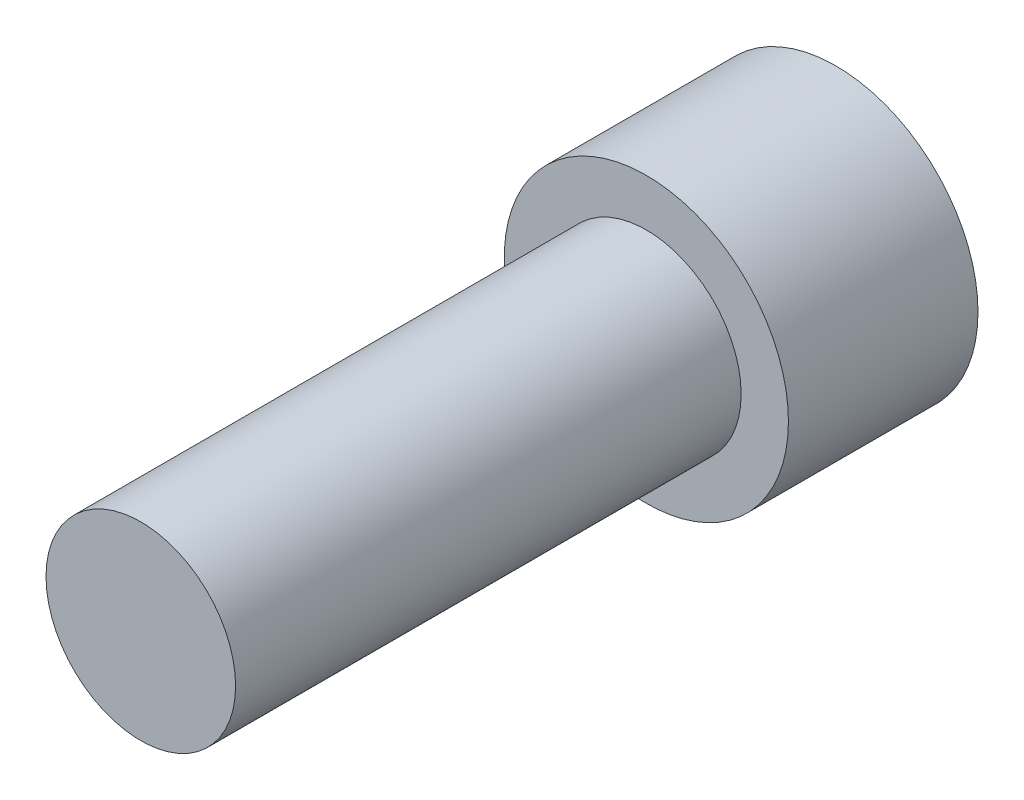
from build123d import *

# Parameters (mm, degrees)
HEX_2_DEPTH = 5.842


with BuildPart() as part:
    # Sketch6 → Revolve1 (revolve)
    with BuildSketch(Plane(origin=(0, 0, 0), x_dir=(0, 0, -1), z_dir=(1, 0, 0)), mode=Mode.PRIVATE) as revolve1_sk:
        Polygon((-25.4, 0), (-25.4, -4.7625), (0, -4.7625), (0, -7.1374), (9.525, -7.1374), (9.525, 0), align=None)
    revolve(revolve1_sk.sketch.rotate(Axis((0, 0, 25.4), (0, 0, -1)), 270), axis=Axis((0, 0, 25.4), (0, 0, -1)))

    # Sketch7 → HEX 2 (cut)
    with BuildSketch(Plane(origin=(0, 0, -9.525), x_dir=(-1, 0, 0), z_dir=(0, 0, -1))):
        Polygon((-3.9624, 2.287692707), (-3.9624, -2.287692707), (0, -4.575385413), (3.9624, -2.287692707), (3.9624, 2.287692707), (0, 4.575385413), align=None)
    extrude(amount=-HEX_2_DEPTH, mode=Mode.SUBTRACT)


solid = part.part
